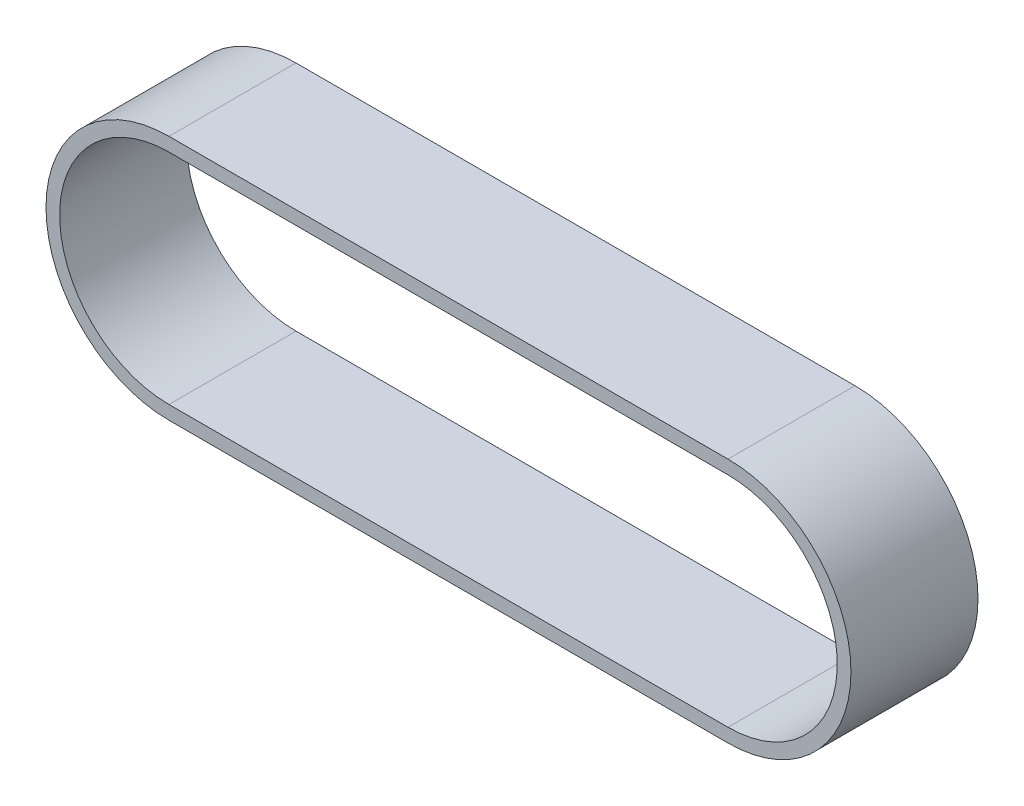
ISO-10303-21;
HEADER;
FILE_DESCRIPTION(('STEP AP214'),'2;1');
FILE_NAME('part.step','',(''),(''),'','','');
FILE_SCHEMA(('AUTOMOTIVE_DESIGN { 1 0 10303 214 1 1 1 1 }'));
ENDSEC;
DATA;
#1=APPLICATION_CONTEXT('core data for automotive mechanical design processes');
#2=APPLICATION_PROTOCOL_DEFINITION('international standard','automotive_design',2000,#1);
#3=PRODUCT_CONTEXT('',#1,'mechanical');
#4=PRODUCT('Part','Part','',(#3));
#5=PRODUCT_RELATED_PRODUCT_CATEGORY('part','',(#4));
#6=PRODUCT_DEFINITION_FORMATION('','',#4);
#7=PRODUCT_DEFINITION_CONTEXT('part definition',#1,'design');
#8=PRODUCT_DEFINITION('design','',#6,#7);
#9=PRODUCT_DEFINITION_SHAPE('','',#8);
#10=(LENGTH_UNIT() NAMED_UNIT(*) SI_UNIT(.MILLI.,.METRE.));
#11=(NAMED_UNIT(*) PLANE_ANGLE_UNIT() SI_UNIT($,.RADIAN.));
#12=(NAMED_UNIT(*) SI_UNIT($,.STERADIAN.) SOLID_ANGLE_UNIT());
#13=UNCERTAINTY_MEASURE_WITH_UNIT(LENGTH_MEASURE(1.E-05),#10,'distance_accuracy_value','');
#14=(GEOMETRIC_REPRESENTATION_CONTEXT(3) GLOBAL_UNCERTAINTY_ASSIGNED_CONTEXT((#13)) GLOBAL_UNIT_ASSIGNED_CONTEXT((#10,
#11,#12)) REPRESENTATION_CONTEXT('',''));
#15=CARTESIAN_POINT('',(0.,0.,0.));
#16=DIRECTION('',(0.,0.,1.));
#17=DIRECTION('',(1.,0.,0.));
#18=AXIS2_PLACEMENT_3D('',#15,#16,#17);
#19=CARTESIAN_POINT('',(-259.842,0.,118.11));
#20=DIRECTION('',(0.,0.,1.));
#21=DIRECTION('',(1.,0.,0.));
#22=AXIS2_PLACEMENT_3D('',#19,#20,#21);
#23=PLANE('',#22);
#24=CARTESIAN_POINT('',(-259.842,0.,118.11));
#25=DIRECTION('',(0.,0.,1.));
#26=DIRECTION('',(1.,0.,0.));
#27=AXIS2_PLACEMENT_3D('',#24,#25,#26);
#28=CIRCLE('',#27,114.3);
#29=CARTESIAN_POINT('',(-259.842,114.3,118.11));
#30=VERTEX_POINT('',#29);
#31=CARTESIAN_POINT('',(-259.842,-114.3,118.11));
#32=VERTEX_POINT('',#31);
#33=EDGE_CURVE('E141',#30,#32,#28,.T.);
#34=ORIENTED_EDGE('',*,*,#33,.T.);
#35=DIRECTION('',(1.,0.,0.));
#36=VECTOR('',#35,1.);
#37=CARTESIAN_POINT('',(-259.842,-114.3,118.11));
#38=LINE('',#37,#36);
#39=CARTESIAN_POINT('',(259.842,-114.3,118.11));
#40=VERTEX_POINT('',#39);
#41=EDGE_CURVE('E144',#32,#40,#38,.T.);
#42=ORIENTED_EDGE('',*,*,#41,.T.);
#43=CARTESIAN_POINT('',(259.842,0.,118.11));
#44=DIRECTION('',(0.,0.,1.));
#45=DIRECTION('',(1.,0.,0.));
#46=AXIS2_PLACEMENT_3D('',#43,#44,#45);
#47=CIRCLE('',#46,114.3);
#48=CARTESIAN_POINT('',(259.842,114.3,118.11));
#49=VERTEX_POINT('',#48);
#50=EDGE_CURVE('E147',#40,#49,#47,.T.);
#51=ORIENTED_EDGE('',*,*,#50,.T.);
#52=DIRECTION('',(-1.,0.,0.));
#53=VECTOR('',#52,1.);
#54=CARTESIAN_POINT('',(-259.842,114.3,118.11));
#55=LINE('',#54,#53);
#56=EDGE_CURVE('E149',#49,#30,#55,.T.);
#57=ORIENTED_EDGE('',*,*,#56,.T.);
#58=EDGE_LOOP('',(#34,#42,#51,#57));
#59=FACE_BOUND('',#58,.T.);
#60=DIRECTION('',(1.,0.,0.));
#61=VECTOR('',#60,1.);
#62=CARTESIAN_POINT('',(-259.842,-101.6,118.11));
#63=LINE('',#62,#61);
#64=CARTESIAN_POINT('',(-259.842,-101.6,118.11));
#65=VERTEX_POINT('',#64);
#66=CARTESIAN_POINT('',(259.842,-101.6,118.11));
#67=VERTEX_POINT('',#66);
#68=EDGE_CURVE('E113',#65,#67,#63,.T.);
#69=ORIENTED_EDGE('',*,*,#68,.F.);
#70=CARTESIAN_POINT('',(-259.842,0.,118.11));
#71=DIRECTION('',(0.,0.,1.));
#72=DIRECTION('',(1.,0.,0.));
#73=AXIS2_PLACEMENT_3D('',#70,#71,#72);
#74=CIRCLE('',#73,101.6);
#75=CARTESIAN_POINT('',(-259.842,101.6,118.11));
#76=VERTEX_POINT('',#75);
#77=EDGE_CURVE('E105',#76,#65,#74,.T.);
#78=ORIENTED_EDGE('',*,*,#77,.F.);
#79=DIRECTION('',(-1.,0.,0.));
#80=VECTOR('',#79,1.);
#81=CARTESIAN_POINT('',(-259.842,101.6,118.11));
#82=LINE('',#81,#80);
#83=CARTESIAN_POINT('',(259.842,101.6,118.11));
#84=VERTEX_POINT('',#83);
#85=EDGE_CURVE('E127',#84,#76,#82,.T.);
#86=ORIENTED_EDGE('',*,*,#85,.F.);
#87=CARTESIAN_POINT('',(259.842,0.,118.11));
#88=DIRECTION('',(0.,0.,1.));
#89=DIRECTION('',(1.,0.,0.));
#90=AXIS2_PLACEMENT_3D('',#87,#88,#89);
#91=CIRCLE('',#90,101.6);
#92=EDGE_CURVE('E125',#67,#84,#91,.T.);
#93=ORIENTED_EDGE('',*,*,#92,.F.);
#94=EDGE_LOOP('',(#69,#78,#86,#93));
#95=FACE_BOUND('',#94,.T.);
#96=ADVANCED_FACE('F40',(#59,#95),#23,.T.);
#97=CARTESIAN_POINT('',(-259.842,0.,0.));
#98=DIRECTION('',(0.,0.,1.));
#99=DIRECTION('',(1.,0.,0.));
#100=AXIS2_PLACEMENT_3D('',#97,#98,#99);
#101=PLANE('',#100);
#102=CARTESIAN_POINT('',(-259.842,0.,0.));
#103=DIRECTION('',(0.,0.,1.));
#104=DIRECTION('',(1.,0.,0.));
#105=AXIS2_PLACEMENT_3D('',#102,#103,#104);
#106=CIRCLE('',#105,114.3);
#107=CARTESIAN_POINT('',(-259.842,114.3,0.));
#108=VERTEX_POINT('',#107);
#109=CARTESIAN_POINT('',(-259.842,-114.3,0.));
#110=VERTEX_POINT('',#109);
#111=EDGE_CURVE('E121',#108,#110,#106,.T.);
#112=ORIENTED_EDGE('',*,*,#111,.F.);
#113=DIRECTION('',(-1.,0.,0.));
#114=VECTOR('',#113,1.);
#115=CARTESIAN_POINT('',(-259.842,114.3,0.));
#116=LINE('',#115,#114);
#117=CARTESIAN_POINT('',(259.842,114.3,0.));
#118=VERTEX_POINT('',#117);
#119=EDGE_CURVE('E145',#118,#108,#116,.T.);
#120=ORIENTED_EDGE('',*,*,#119,.F.);
#121=CARTESIAN_POINT('',(259.842,0.,0.));
#122=DIRECTION('',(0.,0.,1.));
#123=DIRECTION('',(1.,0.,0.));
#124=AXIS2_PLACEMENT_3D('',#121,#122,#123);
#125=CIRCLE('',#124,114.3);
#126=CARTESIAN_POINT('',(259.842,-114.3,0.));
#127=VERTEX_POINT('',#126);
#128=EDGE_CURVE('E156',#127,#118,#125,.T.);
#129=ORIENTED_EDGE('',*,*,#128,.F.);
#130=DIRECTION('',(1.,0.,0.));
#131=VECTOR('',#130,1.);
#132=CARTESIAN_POINT('',(-259.842,-114.3,0.));
#133=LINE('',#132,#131);
#134=EDGE_CURVE('E154',#110,#127,#133,.T.);
#135=ORIENTED_EDGE('',*,*,#134,.F.);
#136=EDGE_LOOP('',(#112,#120,#129,#135));
#137=FACE_BOUND('',#136,.T.);
#138=CARTESIAN_POINT('',(-259.842,0.,0.));
#139=DIRECTION('',(0.,0.,1.));
#140=DIRECTION('',(1.,0.,0.));
#141=AXIS2_PLACEMENT_3D('',#138,#139,#140);
#142=CIRCLE('',#141,101.6);
#143=CARTESIAN_POINT('',(-259.842,101.6,0.));
#144=VERTEX_POINT('',#143);
#145=CARTESIAN_POINT('',(-259.842,-101.6,0.));
#146=VERTEX_POINT('',#145);
#147=EDGE_CURVE('E63',#144,#146,#142,.T.);
#148=ORIENTED_EDGE('',*,*,#147,.T.);
#149=DIRECTION('',(1.,0.,0.));
#150=VECTOR('',#149,1.);
#151=CARTESIAN_POINT('',(-259.842,-101.6,0.));
#152=LINE('',#151,#150);
#153=CARTESIAN_POINT('',(259.842,-101.6,0.));
#154=VERTEX_POINT('',#153);
#155=EDGE_CURVE('E120',#146,#154,#152,.T.);
#156=ORIENTED_EDGE('',*,*,#155,.T.);
#157=CARTESIAN_POINT('',(259.842,0.,0.));
#158=DIRECTION('',(0.,0.,1.));
#159=DIRECTION('',(1.,0.,0.));
#160=AXIS2_PLACEMENT_3D('',#157,#158,#159);
#161=CIRCLE('',#160,101.6);
#162=CARTESIAN_POINT('',(259.842,101.6,0.));
#163=VERTEX_POINT('',#162);
#164=EDGE_CURVE('E133',#154,#163,#161,.T.);
#165=ORIENTED_EDGE('',*,*,#164,.T.);
#166=DIRECTION('',(-1.,0.,0.));
#167=VECTOR('',#166,1.);
#168=CARTESIAN_POINT('',(-259.842,101.6,0.));
#169=LINE('',#168,#167);
#170=EDGE_CURVE('E114',#163,#144,#169,.T.);
#171=ORIENTED_EDGE('',*,*,#170,.T.);
#172=EDGE_LOOP('',(#148,#156,#165,#171));
#173=FACE_BOUND('',#172,.T.);
#174=ADVANCED_FACE('F174',(#137,#173),#101,.F.);
#175=CARTESIAN_POINT('',(-259.842,0.,118.11));
#176=DIRECTION('',(0.,0.,-1.));
#177=DIRECTION('',(-1.,0.,0.));
#178=AXIS2_PLACEMENT_3D('',#175,#176,#177);
#179=CYLINDRICAL_SURFACE('',#178,114.3);
#180=ORIENTED_EDGE('',*,*,#111,.T.);
#181=DIRECTION('',(0.,0.,-1.));
#182=VECTOR('',#181,1.);
#183=CARTESIAN_POINT('',(-259.842,-114.3,118.11));
#184=LINE('',#183,#182);
#185=EDGE_CURVE('E11',#32,#110,#184,.T.);
#186=ORIENTED_EDGE('',*,*,#185,.F.);
#187=ORIENTED_EDGE('',*,*,#33,.F.);
#188=DIRECTION('',(0.,0.,-1.));
#189=VECTOR('',#188,1.);
#190=CARTESIAN_POINT('',(-259.842,114.3,118.11));
#191=LINE('',#190,#189);
#192=EDGE_CURVE('E151',#30,#108,#191,.T.);
#193=ORIENTED_EDGE('',*,*,#192,.T.);
#194=EDGE_LOOP('',(#180,#186,#187,#193));
#195=FACE_BOUND('',#194,.T.);
#196=ADVANCED_FACE('F42',(#195),#179,.T.);
#197=CARTESIAN_POINT('',(-259.842,-114.3,118.11));
#198=DIRECTION('',(0.,1.,0.));
#199=DIRECTION('',(0.,0.,1.));
#200=AXIS2_PLACEMENT_3D('',#197,#198,#199);
#201=PLANE('',#200);
#202=ORIENTED_EDGE('',*,*,#134,.T.);
#203=DIRECTION('',(0.,0.,-1.));
#204=VECTOR('',#203,1.);
#205=CARTESIAN_POINT('',(259.842,-114.3,118.11));
#206=LINE('',#205,#204);
#207=EDGE_CURVE('E48',#40,#127,#206,.T.);
#208=ORIENTED_EDGE('',*,*,#207,.F.);
#209=ORIENTED_EDGE('',*,*,#41,.F.);
#210=ORIENTED_EDGE('',*,*,#185,.T.);
#211=EDGE_LOOP('',(#202,#208,#209,#210));
#212=FACE_BOUND('',#211,.T.);
#213=ADVANCED_FACE('F184',(#212),#201,.F.);
#214=CARTESIAN_POINT('',(259.842,0.,118.11));
#215=DIRECTION('',(0.,0.,-1.));
#216=DIRECTION('',(-1.,0.,0.));
#217=AXIS2_PLACEMENT_3D('',#214,#215,#216);
#218=CYLINDRICAL_SURFACE('',#217,114.3);
#219=ORIENTED_EDGE('',*,*,#128,.T.);
#220=DIRECTION('',(0.,0.,-1.));
#221=VECTOR('',#220,1.);
#222=CARTESIAN_POINT('',(259.842,114.3,118.11));
#223=LINE('',#222,#221);
#224=EDGE_CURVE('E161',#49,#118,#223,.T.);
#225=ORIENTED_EDGE('',*,*,#224,.F.);
#226=ORIENTED_EDGE('',*,*,#50,.F.);
#227=ORIENTED_EDGE('',*,*,#207,.T.);
#228=EDGE_LOOP('',(#219,#225,#226,#227));
#229=FACE_BOUND('',#228,.T.);
#230=ADVANCED_FACE('F168',(#229),#218,.T.);
#231=CARTESIAN_POINT('',(-259.842,114.3,118.11));
#232=DIRECTION('',(0.,-1.,0.));
#233=DIRECTION('',(0.,0.,-1.));
#234=AXIS2_PLACEMENT_3D('',#231,#232,#233);
#235=PLANE('',#234);
#236=ORIENTED_EDGE('',*,*,#119,.T.);
#237=ORIENTED_EDGE('',*,*,#192,.F.);
#238=ORIENTED_EDGE('',*,*,#56,.F.);
#239=ORIENTED_EDGE('',*,*,#224,.T.);
#240=EDGE_LOOP('',(#236,#237,#238,#239));
#241=FACE_BOUND('',#240,.T.);
#242=ADVANCED_FACE('F178',(#241),#235,.F.);
#243=CARTESIAN_POINT('',(-259.842,0.,118.11));
#244=DIRECTION('',(0.,0.,-1.));
#245=DIRECTION('',(-1.,0.,0.));
#246=AXIS2_PLACEMENT_3D('',#243,#244,#245);
#247=CYLINDRICAL_SURFACE('',#246,101.6);
#248=ORIENTED_EDGE('',*,*,#147,.F.);
#249=DIRECTION('',(0.,0.,-1.));
#250=VECTOR('',#249,1.);
#251=CARTESIAN_POINT('',(-259.842,101.6,118.11));
#252=LINE('',#251,#250);
#253=EDGE_CURVE('E109',#76,#144,#252,.T.);
#254=ORIENTED_EDGE('',*,*,#253,.F.);
#255=ORIENTED_EDGE('',*,*,#77,.T.);
#256=DIRECTION('',(0.,0.,-1.));
#257=VECTOR('',#256,1.);
#258=CARTESIAN_POINT('',(-259.842,-101.6,118.11));
#259=LINE('',#258,#257);
#260=EDGE_CURVE('E108',#65,#146,#259,.T.);
#261=ORIENTED_EDGE('',*,*,#260,.T.);
#262=EDGE_LOOP('',(#248,#254,#255,#261));
#263=FACE_BOUND('',#262,.T.);
#264=ADVANCED_FACE('F107',(#263),#247,.F.);
#265=CARTESIAN_POINT('',(-259.842,-101.6,118.11));
#266=DIRECTION('',(0.,1.,0.));
#267=DIRECTION('',(0.,0.,1.));
#268=AXIS2_PLACEMENT_3D('',#265,#266,#267);
#269=PLANE('',#268);
#270=ORIENTED_EDGE('',*,*,#155,.F.);
#271=ORIENTED_EDGE('',*,*,#260,.F.);
#272=ORIENTED_EDGE('',*,*,#68,.T.);
#273=DIRECTION('',(0.,0.,-1.));
#274=VECTOR('',#273,1.);
#275=CARTESIAN_POINT('',(259.842,-101.6,118.11));
#276=LINE('',#275,#274);
#277=EDGE_CURVE('E122',#67,#154,#276,.T.);
#278=ORIENTED_EDGE('',*,*,#277,.T.);
#279=EDGE_LOOP('',(#270,#271,#272,#278));
#280=FACE_BOUND('',#279,.T.);
#281=ADVANCED_FACE('F117',(#280),#269,.T.);
#282=CARTESIAN_POINT('',(259.842,0.,118.11));
#283=DIRECTION('',(0.,0.,-1.));
#284=DIRECTION('',(-1.,0.,0.));
#285=AXIS2_PLACEMENT_3D('',#282,#283,#284);
#286=CYLINDRICAL_SURFACE('',#285,101.6);
#287=ORIENTED_EDGE('',*,*,#164,.F.);
#288=ORIENTED_EDGE('',*,*,#277,.F.);
#289=ORIENTED_EDGE('',*,*,#92,.T.);
#290=DIRECTION('',(0.,0.,-1.));
#291=VECTOR('',#290,1.);
#292=CARTESIAN_POINT('',(259.842,101.6,118.11));
#293=LINE('',#292,#291);
#294=EDGE_CURVE('E55',#84,#163,#293,.T.);
#295=ORIENTED_EDGE('',*,*,#294,.T.);
#296=EDGE_LOOP('',(#287,#288,#289,#295));
#297=FACE_BOUND('',#296,.T.);
#298=ADVANCED_FACE('F207',(#297),#286,.F.);
#299=CARTESIAN_POINT('',(-259.842,101.6,118.11));
#300=DIRECTION('',(0.,-1.,0.));
#301=DIRECTION('',(0.,0.,-1.));
#302=AXIS2_PLACEMENT_3D('',#299,#300,#301);
#303=PLANE('',#302);
#304=ORIENTED_EDGE('',*,*,#170,.F.);
#305=ORIENTED_EDGE('',*,*,#294,.F.);
#306=ORIENTED_EDGE('',*,*,#85,.T.);
#307=ORIENTED_EDGE('',*,*,#253,.T.);
#308=EDGE_LOOP('',(#304,#305,#306,#307));
#309=FACE_BOUND('',#308,.T.);
#310=ADVANCED_FACE('F211',(#309),#303,.T.);
#311=CLOSED_SHELL('',(#96,#174,#196,#213,#230,#242,#264,#281,#298,#310));
#312=MANIFOLD_SOLID_BREP('B2',#311);
#313=ADVANCED_BREP_SHAPE_REPRESENTATION('',(#18,#312),#14);
#314=SHAPE_DEFINITION_REPRESENTATION(#9,#313);
ENDSEC;
END-ISO-10303-21;
